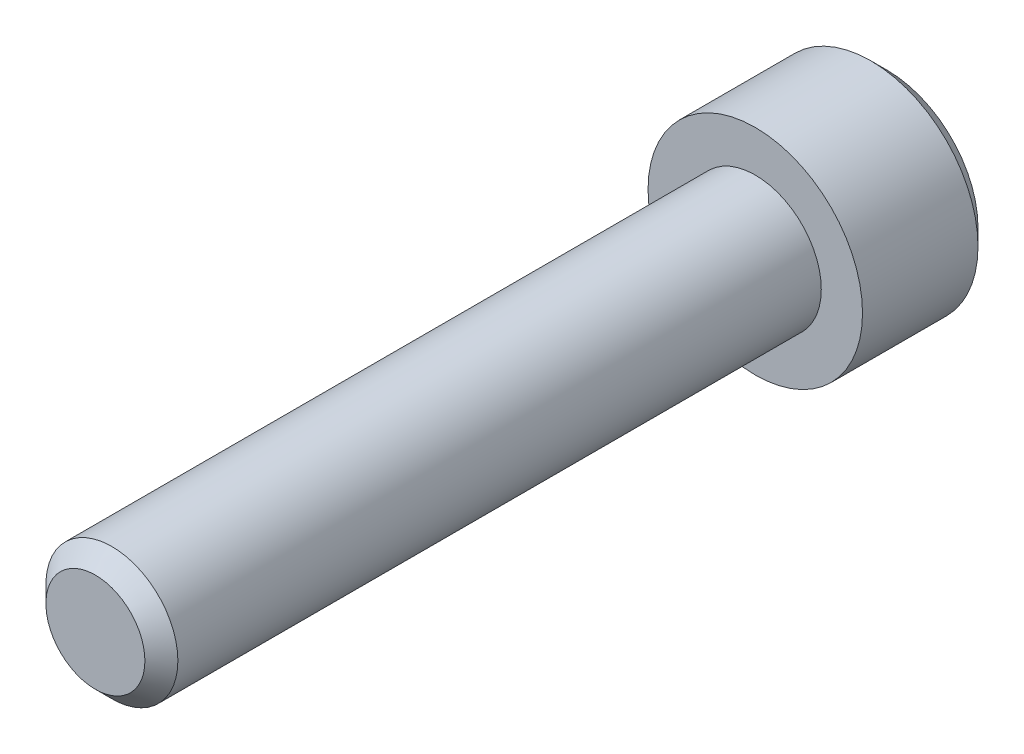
ISO-10303-21;
HEADER;
FILE_DESCRIPTION(('STEP AP214'),'2;1');
FILE_NAME('part.step','',(''),(''),'','','');
FILE_SCHEMA(('AUTOMOTIVE_DESIGN { 1 0 10303 214 1 1 1 1 }'));
ENDSEC;
DATA;
#1=APPLICATION_CONTEXT('core data for automotive mechanical design processes');
#2=APPLICATION_PROTOCOL_DEFINITION('international standard','automotive_design',2000,#1);
#3=PRODUCT_CONTEXT('',#1,'mechanical');
#4=PRODUCT('Part','Part','',(#3));
#5=PRODUCT_RELATED_PRODUCT_CATEGORY('part','',(#4));
#6=PRODUCT_DEFINITION_FORMATION('','',#4);
#7=PRODUCT_DEFINITION_CONTEXT('part definition',#1,'design');
#8=PRODUCT_DEFINITION('design','',#6,#7);
#9=PRODUCT_DEFINITION_SHAPE('','',#8);
#10=(LENGTH_UNIT() NAMED_UNIT(*) SI_UNIT(.MILLI.,.METRE.));
#11=(NAMED_UNIT(*) PLANE_ANGLE_UNIT() SI_UNIT($,.RADIAN.));
#12=(NAMED_UNIT(*) SI_UNIT($,.STERADIAN.) SOLID_ANGLE_UNIT());
#13=UNCERTAINTY_MEASURE_WITH_UNIT(LENGTH_MEASURE(1.E-05),#10,'distance_accuracy_value','');
#14=(GEOMETRIC_REPRESENTATION_CONTEXT(3) GLOBAL_UNCERTAINTY_ASSIGNED_CONTEXT((#13)) GLOBAL_UNIT_ASSIGNED_CONTEXT((#10,
#11,#12)) REPRESENTATION_CONTEXT('',''));
#15=CARTESIAN_POINT('',(0.,0.,0.));
#16=DIRECTION('',(0.,0.,1.));
#17=DIRECTION('',(1.,0.,0.));
#18=AXIS2_PLACEMENT_3D('',#15,#16,#17);
#19=CARTESIAN_POINT('',(-14.9999830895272,-16.999997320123,-91.));
#20=DIRECTION('',(0.,0.,-1.));
#21=DIRECTION('',(-1.,0.,0.));
#22=AXIS2_PLACEMENT_3D('',#19,#20,#21);
#23=PLANE('',#22);
#24=DIRECTION('',(-1.,0.,0.));
#25=VECTOR('',#24,1.);
#26=CARTESIAN_POINT('',(-13.2679322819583,-19.999997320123,-91.));
#27=LINE('',#26,#25);
#28=CARTESIAN_POINT('',(-13.2679322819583,-19.999997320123,-91.));
#29=VERTEX_POINT('',#28);
#30=CARTESIAN_POINT('',(-16.7320338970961,-19.999997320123,-91.));
#31=VERTEX_POINT('',#30);
#32=EDGE_CURVE('E301',#29,#31,#27,.T.);
#33=ORIENTED_EDGE('',*,*,#32,.F.);
#34=DIRECTION('',(-0.5,-0.866025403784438,0.));
#35=VECTOR('',#34,1.);
#36=CARTESIAN_POINT('',(-11.5358814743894,-16.999997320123,-91.));
#37=LINE('',#36,#35);
#38=CARTESIAN_POINT('',(-11.5358814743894,-16.999997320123,-91.));
#39=VERTEX_POINT('',#38);
#40=EDGE_CURVE('E88',#39,#29,#37,.T.);
#41=ORIENTED_EDGE('',*,*,#40,.F.);
#42=DIRECTION('',(0.5,-0.866025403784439,0.));
#43=VECTOR('',#42,1.);
#44=CARTESIAN_POINT('',(-13.2679322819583,-13.999997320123,-91.));
#45=LINE('',#44,#43);
#46=CARTESIAN_POINT('',(-13.2679322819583,-13.999997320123,-91.));
#47=VERTEX_POINT('',#46);
#48=EDGE_CURVE('E31',#47,#39,#45,.T.);
#49=ORIENTED_EDGE('',*,*,#48,.F.);
#50=DIRECTION('',(1.,0.,0.));
#51=VECTOR('',#50,1.);
#52=CARTESIAN_POINT('',(-16.7320338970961,-13.999997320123,-91.));
#53=LINE('',#52,#51);
#54=CARTESIAN_POINT('',(-16.7320338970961,-13.999997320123,-91.));
#55=VERTEX_POINT('',#54);
#56=EDGE_CURVE('E66',#55,#47,#53,.T.);
#57=ORIENTED_EDGE('',*,*,#56,.F.);
#58=DIRECTION('',(0.5,0.866025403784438,0.));
#59=VECTOR('',#58,1.);
#60=CARTESIAN_POINT('',(-18.4640847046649,-16.999997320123,-91.));
#61=LINE('',#60,#59);
#62=CARTESIAN_POINT('',(-18.4640847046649,-16.999997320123,-91.));
#63=VERTEX_POINT('',#62);
#64=EDGE_CURVE('E76',#63,#55,#61,.T.);
#65=ORIENTED_EDGE('',*,*,#64,.F.);
#66=DIRECTION('',(-0.5,0.86602540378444,0.));
#67=VECTOR('',#66,1.);
#68=CARTESIAN_POINT('',(-16.7320338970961,-19.999997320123,-91.));
#69=LINE('',#68,#67);
#70=EDGE_CURVE('E82',#31,#63,#69,.T.);
#71=ORIENTED_EDGE('',*,*,#70,.F.);
#72=EDGE_LOOP('',(#33,#41,#49,#57,#65,#71));
#73=FACE_BOUND('',#72,.T.);
#74=CARTESIAN_POINT('',(-14.9999830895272,-16.999997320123,-91.));
#75=DIRECTION('',(0.,0.,-1.));
#76=DIRECTION('',(-1.,0.,0.));
#77=AXIS2_PLACEMENT_3D('',#74,#75,#76);
#78=CIRCLE('',#77,5.5);
#79=CARTESIAN_POINT('',(-20.4999830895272,-16.999997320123,-91.));
#80=VERTEX_POINT('',#79);
#81=EDGE_CURVE('E110',#80,#80,#78,.T.);
#82=ORIENTED_EDGE('',*,*,#81,.T.);
#83=EDGE_LOOP('',(#82));
#84=FACE_BOUND('',#83,.T.);
#85=ADVANCED_FACE('F16',(#73,#84),#23,.T.);
#86=CARTESIAN_POINT('',(-14.9999830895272,-16.999997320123,-83.));
#87=DIRECTION('',(0.,0.,1.));
#88=DIRECTION('',(1.,0.,0.));
#89=AXIS2_PLACEMENT_3D('',#86,#87,#88);
#90=PLANE('',#89);
#91=CARTESIAN_POINT('',(-14.9999830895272,-16.999997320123,-83.));
#92=DIRECTION('',(0.,0.,1.));
#93=DIRECTION('',(1.,0.,0.));
#94=AXIS2_PLACEMENT_3D('',#91,#92,#93);
#95=CIRCLE('',#94,4.);
#96=CARTESIAN_POINT('',(-10.9999830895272,-16.999997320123,-83.));
#97=VERTEX_POINT('',#96);
#98=EDGE_CURVE('E113',#97,#97,#95,.T.);
#99=ORIENTED_EDGE('',*,*,#98,.F.);
#100=EDGE_LOOP('',(#99));
#101=FACE_BOUND('',#100,.T.);
#102=CARTESIAN_POINT('',(-14.9999830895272,-16.999997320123,-83.));
#103=DIRECTION('',(0.,0.,-1.));
#104=DIRECTION('',(-1.,0.,0.));
#105=AXIS2_PLACEMENT_3D('',#102,#103,#104);
#106=CIRCLE('',#105,6.5);
#107=CARTESIAN_POINT('',(-21.4999830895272,-16.999997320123,-83.));
#108=VERTEX_POINT('',#107);
#109=EDGE_CURVE('E102',#108,#108,#106,.T.);
#110=ORIENTED_EDGE('',*,*,#109,.F.);
#111=EDGE_LOOP('',(#110));
#112=FACE_BOUND('',#111,.T.);
#113=ADVANCED_FACE('F133',(#101,#112),#90,.T.);
#114=CARTESIAN_POINT('',(-14.9999830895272,-16.999997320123,-83.));
#115=DIRECTION('',(0.,0.,-1.));
#116=DIRECTION('',(-1.,0.,0.));
#117=AXIS2_PLACEMENT_3D('',#114,#115,#116);
#118=CYLINDRICAL_SURFACE('',#117,6.5);
#119=CARTESIAN_POINT('',(-14.9999830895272,-16.999997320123,-90.));
#120=DIRECTION('',(0.,0.,-1.));
#121=DIRECTION('',(-1.,0.,0.));
#122=AXIS2_PLACEMENT_3D('',#119,#120,#121);
#123=CIRCLE('',#122,6.5);
#124=CARTESIAN_POINT('',(-21.4999830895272,-16.999997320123,-90.));
#125=VERTEX_POINT('',#124);
#126=EDGE_CURVE('E107',#125,#125,#123,.F.);
#127=ORIENTED_EDGE('',*,*,#126,.T.);
#128=EDGE_LOOP('',(#127));
#129=FACE_BOUND('',#128,.T.);
#130=ORIENTED_EDGE('',*,*,#109,.T.);
#131=EDGE_LOOP('',(#130));
#132=FACE_BOUND('',#131,.T.);
#133=ADVANCED_FACE('F138',(#129,#132),#118,.T.);
#134=CARTESIAN_POINT('',(-14.9999830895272,-16.999997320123,-90.));
#135=DIRECTION('',(0.,0.,1.));
#136=DIRECTION('',(1.,0.,0.));
#137=AXIS2_PLACEMENT_3D('',#134,#135,#136);
#138=CONICAL_SURFACE('',#137,6.5,0.785398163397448);
#139=ORIENTED_EDGE('',*,*,#81,.F.);
#140=EDGE_LOOP('',(#139));
#141=FACE_BOUND('',#140,.T.);
#142=ORIENTED_EDGE('',*,*,#126,.F.);
#143=EDGE_LOOP('',(#142));
#144=FACE_BOUND('',#143,.T.);
#145=ADVANCED_FACE('F144',(#141,#144),#138,.T.);
#146=CARTESIAN_POINT('',(-13.2679322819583,-19.999997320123,-87.));
#147=DIRECTION('',(0.,-1.,0.));
#148=DIRECTION('',(1.,0.,0.));
#149=AXIS2_PLACEMENT_3D('',#146,#147,#148);
#150=PLANE('',#149);
#151=ORIENTED_EDGE('',*,*,#32,.T.);
#152=DIRECTION('',(0.,0.,-1.));
#153=VECTOR('',#152,1.);
#154=CARTESIAN_POINT('',(-16.7320338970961,-19.999997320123,-87.));
#155=LINE('',#154,#153);
#156=CARTESIAN_POINT('',(-16.7320338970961,-19.999997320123,-87.));
#157=VERTEX_POINT('',#156);
#158=EDGE_CURVE('E100',#157,#31,#155,.T.);
#159=ORIENTED_EDGE('',*,*,#158,.F.);
#160=DIRECTION('',(-1.,0.,0.));
#161=VECTOR('',#160,1.);
#162=CARTESIAN_POINT('',(-13.2679322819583,-19.999997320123,-87.));
#163=LINE('',#162,#161);
#164=CARTESIAN_POINT('',(-13.2679322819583,-19.999997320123,-87.));
#165=VERTEX_POINT('',#164);
#166=EDGE_CURVE('E94',#165,#157,#163,.T.);
#167=ORIENTED_EDGE('',*,*,#166,.F.);
#168=DIRECTION('',(0.,0.,-1.));
#169=VECTOR('',#168,1.);
#170=CARTESIAN_POINT('',(-13.2679322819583,-19.999997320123,-87.));
#171=LINE('',#170,#169);
#172=EDGE_CURVE('E97',#165,#29,#171,.T.);
#173=ORIENTED_EDGE('',*,*,#172,.T.);
#174=EDGE_LOOP('',(#151,#159,#167,#173));
#175=FACE_BOUND('',#174,.T.);
#176=ADVANCED_FACE('F147',(#175),#150,.F.);
#177=CARTESIAN_POINT('',(-16.7320338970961,-19.999997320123,-87.));
#178=DIRECTION('',(-0.86602540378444,-0.5,0.));
#179=DIRECTION('',(0.5,-0.86602540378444,0.));
#180=AXIS2_PLACEMENT_3D('',#177,#178,#179);
#181=PLANE('',#180);
#182=ORIENTED_EDGE('',*,*,#70,.T.);
#183=DIRECTION('',(0.,0.,-1.));
#184=VECTOR('',#183,1.);
#185=CARTESIAN_POINT('',(-18.4640847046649,-16.999997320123,-87.));
#186=LINE('',#185,#184);
#187=CARTESIAN_POINT('',(-18.4640847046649,-16.999997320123,-87.));
#188=VERTEX_POINT('',#187);
#189=EDGE_CURVE('E72',#188,#63,#186,.T.);
#190=ORIENTED_EDGE('',*,*,#189,.F.);
#191=DIRECTION('',(-0.5,0.86602540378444,0.));
#192=VECTOR('',#191,1.);
#193=CARTESIAN_POINT('',(-16.7320338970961,-19.999997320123,-87.));
#194=LINE('',#193,#192);
#195=EDGE_CURVE('E298',#157,#188,#194,.T.);
#196=ORIENTED_EDGE('',*,*,#195,.F.);
#197=ORIENTED_EDGE('',*,*,#158,.T.);
#198=EDGE_LOOP('',(#182,#190,#196,#197));
#199=FACE_BOUND('',#198,.T.);
#200=ADVANCED_FACE('F152',(#199),#181,.F.);
#201=CARTESIAN_POINT('',(-18.4640847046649,-16.999997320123,-87.));
#202=DIRECTION('',(-0.866025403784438,0.5,0.));
#203=DIRECTION('',(-0.5,-0.866025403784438,0.));
#204=AXIS2_PLACEMENT_3D('',#201,#202,#203);
#205=PLANE('',#204);
#206=ORIENTED_EDGE('',*,*,#64,.T.);
#207=DIRECTION('',(0.,0.,-1.));
#208=VECTOR('',#207,1.);
#209=CARTESIAN_POINT('',(-16.7320338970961,-13.999997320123,-87.));
#210=LINE('',#209,#208);
#211=CARTESIAN_POINT('',(-16.7320338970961,-13.999997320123,-87.));
#212=VERTEX_POINT('',#211);
#213=EDGE_CURVE('E61',#212,#55,#210,.T.);
#214=ORIENTED_EDGE('',*,*,#213,.F.);
#215=DIRECTION('',(0.5,0.866025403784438,0.));
#216=VECTOR('',#215,1.);
#217=CARTESIAN_POINT('',(-18.4640847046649,-16.999997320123,-87.));
#218=LINE('',#217,#216);
#219=EDGE_CURVE('E304',#188,#212,#218,.T.);
#220=ORIENTED_EDGE('',*,*,#219,.F.);
#221=ORIENTED_EDGE('',*,*,#189,.T.);
#222=EDGE_LOOP('',(#206,#214,#220,#221));
#223=FACE_BOUND('',#222,.T.);
#224=ADVANCED_FACE('F77',(#223),#205,.F.);
#225=CARTESIAN_POINT('',(-16.7320338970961,-13.999997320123,-87.));
#226=DIRECTION('',(0.,1.,0.));
#227=DIRECTION('',(-1.,0.,0.));
#228=AXIS2_PLACEMENT_3D('',#225,#226,#227);
#229=PLANE('',#228);
#230=ORIENTED_EDGE('',*,*,#56,.T.);
#231=DIRECTION('',(0.,0.,-1.));
#232=VECTOR('',#231,1.);
#233=CARTESIAN_POINT('',(-13.2679322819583,-13.999997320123,-87.));
#234=LINE('',#233,#232);
#235=CARTESIAN_POINT('',(-13.2679322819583,-13.999997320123,-87.));
#236=VERTEX_POINT('',#235);
#237=EDGE_CURVE('E73',#236,#47,#234,.T.);
#238=ORIENTED_EDGE('',*,*,#237,.F.);
#239=DIRECTION('',(1.,0.,0.));
#240=VECTOR('',#239,1.);
#241=CARTESIAN_POINT('',(-16.7320338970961,-13.999997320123,-87.));
#242=LINE('',#241,#240);
#243=EDGE_CURVE('E69',#212,#236,#242,.T.);
#244=ORIENTED_EDGE('',*,*,#243,.F.);
#245=ORIENTED_EDGE('',*,*,#213,.T.);
#246=EDGE_LOOP('',(#230,#238,#244,#245));
#247=FACE_BOUND('',#246,.T.);
#248=ADVANCED_FACE('F63',(#247),#229,.F.);
#249=CARTESIAN_POINT('',(-13.2679322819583,-13.999997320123,-87.));
#250=DIRECTION('',(0.866025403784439,0.5,0.));
#251=DIRECTION('',(-0.5,0.866025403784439,0.));
#252=AXIS2_PLACEMENT_3D('',#249,#250,#251);
#253=PLANE('',#252);
#254=ORIENTED_EDGE('',*,*,#48,.T.);
#255=DIRECTION('',(0.,0.,-1.));
#256=VECTOR('',#255,1.);
#257=CARTESIAN_POINT('',(-11.5358814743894,-16.999997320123,-87.));
#258=LINE('',#257,#256);
#259=CARTESIAN_POINT('',(-11.5358814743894,-16.999997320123,-87.));
#260=VERTEX_POINT('',#259);
#261=EDGE_CURVE('E95',#260,#39,#258,.T.);
#262=ORIENTED_EDGE('',*,*,#261,.F.);
#263=DIRECTION('',(0.5,-0.866025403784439,0.));
#264=VECTOR('',#263,1.);
#265=CARTESIAN_POINT('',(-13.2679322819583,-13.999997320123,-87.));
#266=LINE('',#265,#264);
#267=EDGE_CURVE('E40',#236,#260,#266,.T.);
#268=ORIENTED_EDGE('',*,*,#267,.F.);
#269=ORIENTED_EDGE('',*,*,#237,.T.);
#270=EDGE_LOOP('',(#254,#262,#268,#269));
#271=FACE_BOUND('',#270,.T.);
#272=ADVANCED_FACE('F171',(#271),#253,.F.);
#273=CARTESIAN_POINT('',(-11.5358814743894,-16.999997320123,-87.));
#274=DIRECTION('',(0.866025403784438,-0.5,0.));
#275=DIRECTION('',(0.5,0.866025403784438,0.));
#276=AXIS2_PLACEMENT_3D('',#273,#274,#275);
#277=PLANE('',#276);
#278=ORIENTED_EDGE('',*,*,#40,.T.);
#279=ORIENTED_EDGE('',*,*,#172,.F.);
#280=DIRECTION('',(-0.5,-0.866025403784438,0.));
#281=VECTOR('',#280,1.);
#282=CARTESIAN_POINT('',(-11.5358814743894,-16.999997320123,-87.));
#283=LINE('',#282,#281);
#284=EDGE_CURVE('E104',#260,#165,#283,.T.);
#285=ORIENTED_EDGE('',*,*,#284,.F.);
#286=ORIENTED_EDGE('',*,*,#261,.T.);
#287=EDGE_LOOP('',(#278,#279,#285,#286));
#288=FACE_BOUND('',#287,.T.);
#289=ADVANCED_FACE('F174',(#288),#277,.F.);
#290=CARTESIAN_POINT('',(-13.2679322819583,-19.999997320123,-87.));
#291=DIRECTION('',(0.,-0.5,0.866025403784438));
#292=DIRECTION('',(0.,-0.866025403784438,-0.5));
#293=AXIS2_PLACEMENT_3D('',#290,#291,#292);
#294=PLANE('',#293);
#295=ORIENTED_EDGE('',*,*,#166,.T.);
#296=DIRECTION('',(-0.44721359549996,-0.774596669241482,-0.447213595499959));
#297=VECTOR('',#296,1.);
#298=CARTESIAN_POINT('',(-16.0392135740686,-18.799997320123,-86.3071796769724));
#299=LINE('',#298,#297);
#300=CARTESIAN_POINT('',(-14.9999830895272,-16.999997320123,-85.2679491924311));
#301=VERTEX_POINT('',#300);
#302=EDGE_CURVE('E291',#301,#157,#299,.T.);
#303=ORIENTED_EDGE('',*,*,#302,.F.);
#304=DIRECTION('',(0.447213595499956,-0.774596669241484,-0.447213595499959));
#305=VECTOR('',#304,1.);
#306=CARTESIAN_POINT('',(-13.9607526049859,-18.799997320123,-86.3071796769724));
#307=LINE('',#306,#305);
#308=EDGE_CURVE('E294',#301,#165,#307,.T.);
#309=ORIENTED_EDGE('',*,*,#308,.T.);
#310=EDGE_LOOP('',(#295,#303,#309));
#311=FACE_BOUND('',#310,.T.);
#312=ADVANCED_FACE('F177',(#311),#294,.F.);
#313=CARTESIAN_POINT('',(-16.7320338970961,-19.999997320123,-87.));
#314=DIRECTION('',(-0.433012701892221,-0.25,0.866025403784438));
#315=DIRECTION('',(0.894427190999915,0.,0.447213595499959));
#316=AXIS2_PLACEMENT_3D('',#313,#314,#315);
#317=PLANE('',#316);
#318=ORIENTED_EDGE('',*,*,#195,.T.);
#319=DIRECTION('',(-0.894427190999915,0.,-0.447213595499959));
#320=VECTOR('',#319,1.);
#321=CARTESIAN_POINT('',(-17.0784440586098,-16.999997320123,-86.3071796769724));
#322=LINE('',#321,#320);
#323=EDGE_CURVE('E324',#301,#188,#322,.T.);
#324=ORIENTED_EDGE('',*,*,#323,.F.);
#325=ORIENTED_EDGE('',*,*,#302,.T.);
#326=EDGE_LOOP('',(#318,#324,#325));
#327=FACE_BOUND('',#326,.T.);
#328=ADVANCED_FACE('F193',(#327),#317,.F.);
#329=CARTESIAN_POINT('',(-18.4640847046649,-16.999997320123,-87.));
#330=DIRECTION('',(-0.43301270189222,0.25,0.866025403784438));
#331=DIRECTION('',(0.894427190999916,0.,0.447213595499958));
#332=AXIS2_PLACEMENT_3D('',#329,#330,#331);
#333=PLANE('',#332);
#334=ORIENTED_EDGE('',*,*,#219,.T.);
#335=DIRECTION('',(-0.447213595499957,0.774596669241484,-0.447213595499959));
#336=VECTOR('',#335,1.);
#337=CARTESIAN_POINT('',(-16.0392135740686,-15.199997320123,-86.3071796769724));
#338=LINE('',#337,#336);
#339=EDGE_CURVE('E325',#301,#212,#338,.T.);
#340=ORIENTED_EDGE('',*,*,#339,.F.);
#341=ORIENTED_EDGE('',*,*,#323,.T.);
#342=EDGE_LOOP('',(#334,#340,#341));
#343=FACE_BOUND('',#342,.T.);
#344=ADVANCED_FACE('F189',(#343),#333,.F.);
#345=CARTESIAN_POINT('',(-16.7320338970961,-13.999997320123,-87.));
#346=DIRECTION('',(0.,0.5,0.866025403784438));
#347=DIRECTION('',(0.,-0.866025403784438,0.5));
#348=AXIS2_PLACEMENT_3D('',#345,#346,#347);
#349=PLANE('',#348);
#350=ORIENTED_EDGE('',*,*,#243,.T.);
#351=DIRECTION('',(0.447213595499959,0.774596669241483,-0.447213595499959));
#352=VECTOR('',#351,1.);
#353=CARTESIAN_POINT('',(-13.9607526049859,-15.199997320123,-86.3071796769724));
#354=LINE('',#353,#352);
#355=EDGE_CURVE('E318',#301,#236,#354,.T.);
#356=ORIENTED_EDGE('',*,*,#355,.F.);
#357=ORIENTED_EDGE('',*,*,#339,.T.);
#358=EDGE_LOOP('',(#350,#356,#357));
#359=FACE_BOUND('',#358,.T.);
#360=ADVANCED_FACE('F186',(#359),#349,.F.);
#361=CARTESIAN_POINT('',(-13.2679322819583,-13.999997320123,-87.));
#362=DIRECTION('',(0.43301270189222,0.25,0.866025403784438));
#363=DIRECTION('',(0.894427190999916,0.,-0.447213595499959));
#364=AXIS2_PLACEMENT_3D('',#361,#362,#363);
#365=PLANE('',#364);
#366=ORIENTED_EDGE('',*,*,#267,.T.);
#367=DIRECTION('',(0.894427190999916,0.,-0.447213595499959));
#368=VECTOR('',#367,1.);
#369=CARTESIAN_POINT('',(-12.9215221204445,-16.999997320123,-86.3071796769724));
#370=LINE('',#369,#368);
#371=EDGE_CURVE('E331',#301,#260,#370,.T.);
#372=ORIENTED_EDGE('',*,*,#371,.F.);
#373=ORIENTED_EDGE('',*,*,#355,.T.);
#374=EDGE_LOOP('',(#366,#372,#373));
#375=FACE_BOUND('',#374,.T.);
#376=ADVANCED_FACE('F182',(#375),#365,.F.);
#377=CARTESIAN_POINT('',(-11.5358814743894,-16.999997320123,-87.));
#378=DIRECTION('',(0.43301270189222,-0.25,0.866025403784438));
#379=DIRECTION('',(0.894427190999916,0.,-0.447213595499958));
#380=AXIS2_PLACEMENT_3D('',#377,#378,#379);
#381=PLANE('',#380);
#382=ORIENTED_EDGE('',*,*,#284,.T.);
#383=ORIENTED_EDGE('',*,*,#308,.F.);
#384=ORIENTED_EDGE('',*,*,#371,.T.);
#385=EDGE_LOOP('',(#382,#383,#384));
#386=FACE_BOUND('',#385,.T.);
#387=ADVANCED_FACE('F179',(#386),#381,.F.);
#388=CARTESIAN_POINT('',(-14.9999830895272,-16.999997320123,-63.));
#389=DIRECTION('',(0.,0.,-1.));
#390=DIRECTION('',(-1.,0.,0.));
#391=AXIS2_PLACEMENT_3D('',#388,#389,#390);
#392=CYLINDRICAL_SURFACE('',#391,4.);
#393=CARTESIAN_POINT('',(-14.9999830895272,-16.999997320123,-44.));
#394=DIRECTION('',(0.,0.,1.));
#395=DIRECTION('',(1.,0.,0.));
#396=AXIS2_PLACEMENT_3D('',#393,#394,#395);
#397=CIRCLE('',#396,4.);
#398=CARTESIAN_POINT('',(-10.9999830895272,-16.999997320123,-44.));
#399=VERTEX_POINT('',#398);
#400=EDGE_CURVE('E20',#399,#399,#397,.F.);
#401=ORIENTED_EDGE('',*,*,#400,.T.);
#402=EDGE_LOOP('',(#401));
#403=FACE_BOUND('',#402,.T.);
#404=ORIENTED_EDGE('',*,*,#98,.T.);
#405=EDGE_LOOP('',(#404));
#406=FACE_BOUND('',#405,.T.);
#407=ADVANCED_FACE('F120',(#403,#406),#392,.T.);
#408=CARTESIAN_POINT('',(-14.9999830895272,-16.999997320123,-43.));
#409=DIRECTION('',(0.,0.,1.));
#410=DIRECTION('',(1.,0.,0.));
#411=AXIS2_PLACEMENT_3D('',#408,#409,#410);
#412=PLANE('',#411);
#413=CARTESIAN_POINT('',(-14.9999830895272,-16.999997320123,-43.));
#414=DIRECTION('',(0.,0.,1.));
#415=DIRECTION('',(1.,0.,0.));
#416=AXIS2_PLACEMENT_3D('',#413,#414,#415);
#417=CIRCLE('',#416,3.);
#418=CARTESIAN_POINT('',(-11.9999830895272,-16.999997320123,-43.));
#419=VERTEX_POINT('',#418);
#420=EDGE_CURVE('E11',#419,#419,#417,.T.);
#421=ORIENTED_EDGE('',*,*,#420,.T.);
#422=EDGE_LOOP('',(#421));
#423=FACE_BOUND('',#422,.T.);
#424=ADVANCED_FACE('F18',(#423),#412,.T.);
#425=CARTESIAN_POINT('',(-14.9999830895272,-16.999997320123,-44.));
#426=DIRECTION('',(0.,0.,-1.));
#427=DIRECTION('',(-1.,0.,0.));
#428=AXIS2_PLACEMENT_3D('',#425,#426,#427);
#429=CONICAL_SURFACE('',#428,4.,0.785398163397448);
#430=ORIENTED_EDGE('',*,*,#420,.F.);
#431=EDGE_LOOP('',(#430));
#432=FACE_BOUND('',#431,.T.);
#433=ORIENTED_EDGE('',*,*,#400,.F.);
#434=EDGE_LOOP('',(#433));
#435=FACE_BOUND('',#434,.T.);
#436=ADVANCED_FACE('F122',(#432,#435),#429,.T.);
#437=CLOSED_SHELL('',(#85,#113,#133,#145,#176,#200,#224,#248,#272,#289,#312,#328,#344,#360,#376,
#387,#407,#424,#436));
#438=MANIFOLD_SOLID_BREP('B1',#437);
#439=ADVANCED_BREP_SHAPE_REPRESENTATION('',(#18,#438),#14);
#440=SHAPE_DEFINITION_REPRESENTATION(#9,#439);
ENDSEC;
END-ISO-10303-21;
